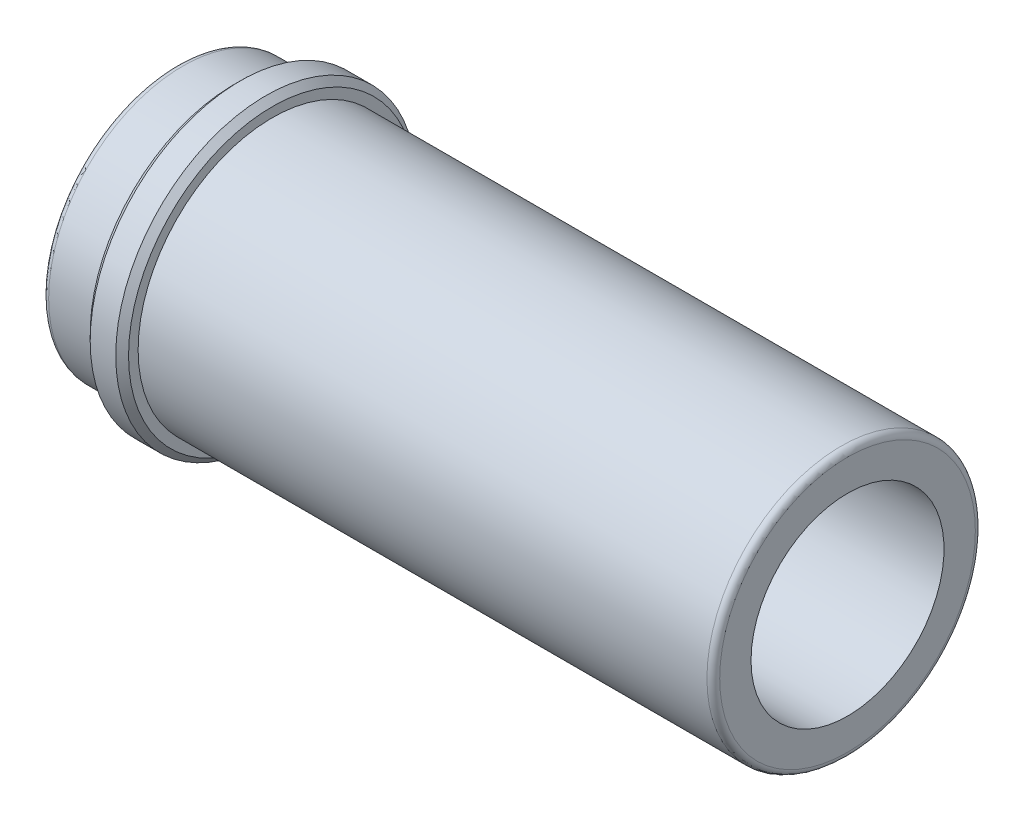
ISO-10303-21;
HEADER;
FILE_DESCRIPTION(('STEP AP214'),'2;1');
FILE_NAME('part.step','',(''),(''),'','','');
FILE_SCHEMA(('AUTOMOTIVE_DESIGN { 1 0 10303 214 1 1 1 1 }'));
ENDSEC;
DATA;
#1=APPLICATION_CONTEXT('core data for automotive mechanical design processes');
#2=APPLICATION_PROTOCOL_DEFINITION('international standard','automotive_design',2000,#1);
#3=PRODUCT_CONTEXT('',#1,'mechanical');
#4=PRODUCT('Part','Part','',(#3));
#5=PRODUCT_RELATED_PRODUCT_CATEGORY('part','',(#4));
#6=PRODUCT_DEFINITION_FORMATION('','',#4);
#7=PRODUCT_DEFINITION_CONTEXT('part definition',#1,'design');
#8=PRODUCT_DEFINITION('design','',#6,#7);
#9=PRODUCT_DEFINITION_SHAPE('','',#8);
#10=(LENGTH_UNIT() NAMED_UNIT(*) SI_UNIT(.MILLI.,.METRE.));
#11=(NAMED_UNIT(*) PLANE_ANGLE_UNIT() SI_UNIT($,.RADIAN.));
#12=(NAMED_UNIT(*) SI_UNIT($,.STERADIAN.) SOLID_ANGLE_UNIT());
#13=UNCERTAINTY_MEASURE_WITH_UNIT(LENGTH_MEASURE(1.E-05),#10,'distance_accuracy_value','');
#14=(GEOMETRIC_REPRESENTATION_CONTEXT(3) GLOBAL_UNCERTAINTY_ASSIGNED_CONTEXT((#13)) GLOBAL_UNIT_ASSIGNED_CONTEXT((#10,
#11,#12)) REPRESENTATION_CONTEXT('',''));
#15=CARTESIAN_POINT('',(0.,0.,0.));
#16=DIRECTION('',(0.,0.,1.));
#17=DIRECTION('',(1.,0.,0.));
#18=AXIS2_PLACEMENT_3D('',#15,#16,#17);
#19=CARTESIAN_POINT('',(9.,21.,0.));
#20=DIRECTION('',(1.,0.,0.));
#21=DIRECTION('',(0.,0.,-1.));
#22=AXIS2_PLACEMENT_3D('',#19,#20,#21);
#23=PLANE('',#22);
#24=CARTESIAN_POINT('',(9.,0.,0.));
#25=DIRECTION('',(1.,0.,0.));
#26=DIRECTION('',(0.,0.,-1.));
#27=AXIS2_PLACEMENT_3D('',#24,#25,#26);
#28=CIRCLE('',#27,22.5);
#29=CARTESIAN_POINT('',(9.,0.,-22.5));
#30=VERTEX_POINT('',#29);
#31=EDGE_CURVE('E9',#30,#30,#28,.F.);
#32=ORIENTED_EDGE('',*,*,#31,.T.);
#33=EDGE_LOOP('',(#32));
#34=FACE_BOUND('',#33,.T.);
#35=CARTESIAN_POINT('',(9.,0.,0.));
#36=DIRECTION('',(-1.,0.,0.));
#37=DIRECTION('',(0.,0.,1.));
#38=AXIS2_PLACEMENT_3D('',#35,#36,#37);
#39=CIRCLE('',#38,21.);
#40=CARTESIAN_POINT('',(9.,0.,21.));
#41=VERTEX_POINT('',#40);
#42=EDGE_CURVE('E55',#41,#41,#39,.T.);
#43=ORIENTED_EDGE('',*,*,#42,.F.);
#44=EDGE_LOOP('',(#43));
#45=FACE_BOUND('',#44,.T.);
#46=ADVANCED_FACE('F14',(#34,#45),#23,.F.);
#47=CARTESIAN_POINT('',(0.,0.,0.));
#48=DIRECTION('',(-1.,0.,0.));
#49=DIRECTION('',(0.,0.,1.));
#50=AXIS2_PLACEMENT_3D('',#47,#48,#49);
#51=CYLINDRICAL_SURFACE('',#50,23.5);
#52=CARTESIAN_POINT('',(14.,0.,0.));
#53=DIRECTION('',(-1.,0.,0.));
#54=DIRECTION('',(0.,0.,1.));
#55=AXIS2_PLACEMENT_3D('',#52,#53,#54);
#56=CIRCLE('',#55,23.5);
#57=CARTESIAN_POINT('',(14.,0.,23.5));
#58=VERTEX_POINT('',#57);
#59=EDGE_CURVE('E25',#58,#58,#56,.T.);
#60=ORIENTED_EDGE('',*,*,#59,.T.);
#61=EDGE_LOOP('',(#60));
#62=FACE_BOUND('',#61,.T.);
#63=CARTESIAN_POINT('',(10.,0.,0.));
#64=DIRECTION('',(1.,0.,0.));
#65=DIRECTION('',(0.,0.,-1.));
#66=AXIS2_PLACEMENT_3D('',#63,#64,#65);
#67=CIRCLE('',#66,23.5);
#68=CARTESIAN_POINT('',(10.,0.,-23.5));
#69=VERTEX_POINT('',#68);
#70=EDGE_CURVE('E29',#69,#69,#67,.T.);
#71=ORIENTED_EDGE('',*,*,#70,.T.);
#72=EDGE_LOOP('',(#71));
#73=FACE_BOUND('',#72,.T.);
#74=ADVANCED_FACE('F62',(#62,#73),#51,.T.);
#75=CARTESIAN_POINT('',(15.,23.5,0.));
#76=DIRECTION('',(-1.,0.,0.));
#77=DIRECTION('',(0.,0.,1.));
#78=AXIS2_PLACEMENT_3D('',#75,#76,#77);
#79=PLANE('',#78);
#80=CARTESIAN_POINT('',(15.,0.,0.));
#81=DIRECTION('',(-1.,0.,0.));
#82=DIRECTION('',(0.,0.,1.));
#83=AXIS2_PLACEMENT_3D('',#80,#81,#82);
#84=CIRCLE('',#83,22.5);
#85=CARTESIAN_POINT('',(15.,0.,22.5));
#86=VERTEX_POINT('',#85);
#87=EDGE_CURVE('E21',#86,#86,#84,.F.);
#88=ORIENTED_EDGE('',*,*,#87,.T.);
#89=EDGE_LOOP('',(#88));
#90=FACE_BOUND('',#89,.T.);
#91=CARTESIAN_POINT('',(15.,0.,0.));
#92=DIRECTION('',(-1.,0.,0.));
#93=DIRECTION('',(0.,0.,1.));
#94=AXIS2_PLACEMENT_3D('',#91,#92,#93);
#95=CIRCLE('',#94,21.);
#96=CARTESIAN_POINT('',(15.,0.,21.));
#97=VERTEX_POINT('',#96);
#98=EDGE_CURVE('E46',#97,#97,#95,.T.);
#99=ORIENTED_EDGE('',*,*,#98,.T.);
#100=EDGE_LOOP('',(#99));
#101=FACE_BOUND('',#100,.T.);
#102=ADVANCED_FACE('F69',(#90,#101),#79,.F.);
#103=CARTESIAN_POINT('',(0.,0.,0.));
#104=DIRECTION('',(-1.,0.,0.));
#105=DIRECTION('',(0.,0.,1.));
#106=AXIS2_PLACEMENT_3D('',#103,#104,#105);
#107=CYLINDRICAL_SURFACE('',#106,21.);
#108=CARTESIAN_POINT('',(104.,0.,0.));
#109=DIRECTION('',(-1.,0.,0.));
#110=DIRECTION('',(0.,0.,1.));
#111=AXIS2_PLACEMENT_3D('',#108,#109,#110);
#112=CIRCLE('',#111,21.);
#113=CARTESIAN_POINT('',(104.,0.,21.));
#114=VERTEX_POINT('',#113);
#115=EDGE_CURVE('E43',#114,#114,#112,.T.);
#116=ORIENTED_EDGE('',*,*,#115,.T.);
#117=EDGE_LOOP('',(#116));
#118=FACE_BOUND('',#117,.T.);
#119=ORIENTED_EDGE('',*,*,#98,.F.);
#120=EDGE_LOOP('',(#119));
#121=FACE_BOUND('',#120,.T.);
#122=ADVANCED_FACE('F114',(#118,#121),#107,.T.);
#123=CARTESIAN_POINT('',(105.,21.,0.));
#124=DIRECTION('',(-1.,0.,0.));
#125=DIRECTION('',(0.,0.,1.));
#126=AXIS2_PLACEMENT_3D('',#123,#124,#125);
#127=PLANE('',#126);
#128=CARTESIAN_POINT('',(105.,0.,0.));
#129=DIRECTION('',(-1.,0.,0.));
#130=DIRECTION('',(0.,0.,1.));
#131=AXIS2_PLACEMENT_3D('',#128,#129,#130);
#132=CIRCLE('',#131,20.);
#133=CARTESIAN_POINT('',(105.,0.,20.));
#134=VERTEX_POINT('',#133);
#135=EDGE_CURVE('E40',#134,#134,#132,.F.);
#136=ORIENTED_EDGE('',*,*,#135,.T.);
#137=EDGE_LOOP('',(#136));
#138=FACE_BOUND('',#137,.T.);
#139=CARTESIAN_POINT('',(105.,0.,0.));
#140=DIRECTION('',(-1.,0.,0.));
#141=DIRECTION('',(0.,0.,1.));
#142=AXIS2_PLACEMENT_3D('',#139,#140,#141);
#143=CIRCLE('',#142,15.1);
#144=CARTESIAN_POINT('',(105.,0.,15.1));
#145=VERTEX_POINT('',#144);
#146=EDGE_CURVE('E49',#145,#145,#143,.T.);
#147=ORIENTED_EDGE('',*,*,#146,.T.);
#148=EDGE_LOOP('',(#147));
#149=FACE_BOUND('',#148,.T.);
#150=ADVANCED_FACE('F144',(#138,#149),#127,.F.);
#151=CARTESIAN_POINT('',(0.,0.,0.));
#152=DIRECTION('',(-1.,0.,0.));
#153=DIRECTION('',(0.,0.,1.));
#154=AXIS2_PLACEMENT_3D('',#151,#152,#153);
#155=CYLINDRICAL_SURFACE('',#154,15.1);
#156=ORIENTED_EDGE('',*,*,#146,.F.);
#157=EDGE_LOOP('',(#156));
#158=FACE_BOUND('',#157,.T.);
#159=CARTESIAN_POINT('',(0.,0.,0.));
#160=DIRECTION('',(-1.,0.,0.));
#161=DIRECTION('',(0.,0.,1.));
#162=AXIS2_PLACEMENT_3D('',#159,#160,#161);
#163=CIRCLE('',#162,15.1);
#164=CARTESIAN_POINT('',(0.,0.,15.1));
#165=VERTEX_POINT('',#164);
#166=EDGE_CURVE('E52',#165,#165,#163,.T.);
#167=ORIENTED_EDGE('',*,*,#166,.T.);
#168=EDGE_LOOP('',(#167));
#169=FACE_BOUND('',#168,.T.);
#170=ADVANCED_FACE('F136',(#158,#169),#155,.F.);
#171=CARTESIAN_POINT('',(0.,15.1,0.));
#172=DIRECTION('',(1.,0.,0.));
#173=DIRECTION('',(0.,0.,-1.));
#174=AXIS2_PLACEMENT_3D('',#171,#172,#173);
#175=PLANE('',#174);
#176=CARTESIAN_POINT('',(0.,0.,0.));
#177=DIRECTION('',(1.,0.,0.));
#178=DIRECTION('',(0.,0.,-1.));
#179=AXIS2_PLACEMENT_3D('',#176,#177,#178);
#180=CIRCLE('',#179,20.);
#181=CARTESIAN_POINT('',(0.,0.,-20.));
#182=VERTEX_POINT('',#181);
#183=EDGE_CURVE('E37',#182,#182,#180,.F.);
#184=ORIENTED_EDGE('',*,*,#183,.T.);
#185=EDGE_LOOP('',(#184));
#186=FACE_BOUND('',#185,.T.);
#187=ORIENTED_EDGE('',*,*,#166,.F.);
#188=EDGE_LOOP('',(#187));
#189=FACE_BOUND('',#188,.T.);
#190=ADVANCED_FACE('F125',(#186,#189),#175,.F.);
#191=CARTESIAN_POINT('',(0.,0.,0.));
#192=DIRECTION('',(-1.,0.,0.));
#193=DIRECTION('',(0.,0.,1.));
#194=AXIS2_PLACEMENT_3D('',#191,#192,#193);
#195=CYLINDRICAL_SURFACE('',#194,21.);
#196=CARTESIAN_POINT('',(1.,0.,0.));
#197=DIRECTION('',(1.,0.,0.));
#198=DIRECTION('',(0.,0.,-1.));
#199=AXIS2_PLACEMENT_3D('',#196,#197,#198);
#200=CIRCLE('',#199,21.);
#201=CARTESIAN_POINT('',(1.,0.,-21.));
#202=VERTEX_POINT('',#201);
#203=EDGE_CURVE('E34',#202,#202,#200,.T.);
#204=ORIENTED_EDGE('',*,*,#203,.T.);
#205=EDGE_LOOP('',(#204));
#206=FACE_BOUND('',#205,.T.);
#207=ORIENTED_EDGE('',*,*,#42,.T.);
#208=EDGE_LOOP('',(#207));
#209=FACE_BOUND('',#208,.T.);
#210=ADVANCED_FACE('F59',(#206,#209),#195,.T.);
#211=CARTESIAN_POINT('',(104.,0.,0.));
#212=DIRECTION('',(-1.,0.,0.));
#213=DIRECTION('',(0.,0.,1.));
#214=AXIS2_PLACEMENT_3D('',#211,#212,#213);
#215=TOROIDAL_SURFACE('',#214,20.,1.);
#216=ORIENTED_EDGE('',*,*,#135,.F.);
#217=EDGE_LOOP('',(#216));
#218=FACE_BOUND('',#217,.T.);
#219=ORIENTED_EDGE('',*,*,#115,.F.);
#220=EDGE_LOOP('',(#219));
#221=FACE_BOUND('',#220,.T.);
#222=ADVANCED_FACE('F74',(#218,#221),#215,.T.);
#223=CARTESIAN_POINT('',(1.,0.,0.));
#224=DIRECTION('',(1.,0.,0.));
#225=DIRECTION('',(0.,0.,-1.));
#226=AXIS2_PLACEMENT_3D('',#223,#224,#225);
#227=TOROIDAL_SURFACE('',#226,20.,1.);
#228=ORIENTED_EDGE('',*,*,#203,.F.);
#229=EDGE_LOOP('',(#228));
#230=FACE_BOUND('',#229,.T.);
#231=ORIENTED_EDGE('',*,*,#183,.F.);
#232=EDGE_LOOP('',(#231));
#233=FACE_BOUND('',#232,.T.);
#234=ADVANCED_FACE('F77',(#230,#233),#227,.T.);
#235=CARTESIAN_POINT('',(14.,0.,0.));
#236=DIRECTION('',(-1.,0.,0.));
#237=DIRECTION('',(0.,0.,1.));
#238=AXIS2_PLACEMENT_3D('',#235,#236,#237);
#239=CONICAL_SURFACE('',#238,23.5,0.785398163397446);
#240=ORIENTED_EDGE('',*,*,#87,.F.);
#241=EDGE_LOOP('',(#240));
#242=FACE_BOUND('',#241,.T.);
#243=ORIENTED_EDGE('',*,*,#59,.F.);
#244=EDGE_LOOP('',(#243));
#245=FACE_BOUND('',#244,.T.);
#246=ADVANCED_FACE('F80',(#242,#245),#239,.T.);
#247=CARTESIAN_POINT('',(9.,0.,0.));
#248=DIRECTION('',(1.,0.,0.));
#249=DIRECTION('',(0.,0.,-1.));
#250=AXIS2_PLACEMENT_3D('',#247,#248,#249);
#251=CONICAL_SURFACE('',#250,22.5,0.785398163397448);
#252=ORIENTED_EDGE('',*,*,#70,.F.);
#253=EDGE_LOOP('',(#252));
#254=FACE_BOUND('',#253,.T.);
#255=ORIENTED_EDGE('',*,*,#31,.F.);
#256=EDGE_LOOP('',(#255));
#257=FACE_BOUND('',#256,.T.);
#258=ADVANCED_FACE('F16',(#254,#257),#251,.T.);
#259=CLOSED_SHELL('',(#46,#74,#102,#122,#150,#170,#190,#210,#222,#234,#246,#258));
#260=MANIFOLD_SOLID_BREP('B1',#259);
#261=ADVANCED_BREP_SHAPE_REPRESENTATION('',(#18,#260),#14);
#262=SHAPE_DEFINITION_REPRESENTATION(#9,#261);
ENDSEC;
END-ISO-10303-21;
